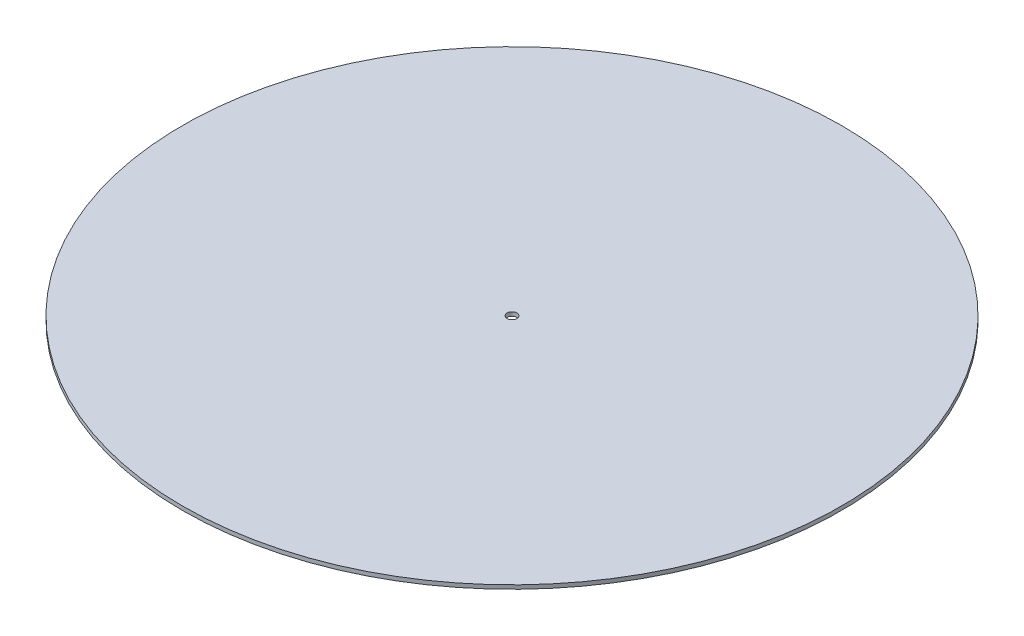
ISO-10303-21;
HEADER;
FILE_DESCRIPTION(('STEP AP214'),'2;1');
FILE_NAME('part.step','',(''),(''),'','','');
FILE_SCHEMA(('AUTOMOTIVE_DESIGN { 1 0 10303 214 1 1 1 1 }'));
ENDSEC;
DATA;
#1=APPLICATION_CONTEXT('core data for automotive mechanical design processes');
#2=APPLICATION_PROTOCOL_DEFINITION('international standard','automotive_design',2000,#1);
#3=PRODUCT_CONTEXT('',#1,'mechanical');
#4=PRODUCT('Part','Part','',(#3));
#5=PRODUCT_RELATED_PRODUCT_CATEGORY('part','',(#4));
#6=PRODUCT_DEFINITION_FORMATION('','',#4);
#7=PRODUCT_DEFINITION_CONTEXT('part definition',#1,'design');
#8=PRODUCT_DEFINITION('design','',#6,#7);
#9=PRODUCT_DEFINITION_SHAPE('','',#8);
#10=(LENGTH_UNIT() NAMED_UNIT(*) SI_UNIT(.MILLI.,.METRE.));
#11=(NAMED_UNIT(*) PLANE_ANGLE_UNIT() SI_UNIT($,.RADIAN.));
#12=(NAMED_UNIT(*) SI_UNIT($,.STERADIAN.) SOLID_ANGLE_UNIT());
#13=UNCERTAINTY_MEASURE_WITH_UNIT(LENGTH_MEASURE(1.E-05),#10,'distance_accuracy_value','');
#14=(GEOMETRIC_REPRESENTATION_CONTEXT(3) GLOBAL_UNCERTAINTY_ASSIGNED_CONTEXT((#13)) GLOBAL_UNIT_ASSIGNED_CONTEXT((#10,
#11,#12)) REPRESENTATION_CONTEXT('',''));
#15=CARTESIAN_POINT('',(0.,0.,0.));
#16=DIRECTION('',(0.,0.,1.));
#17=DIRECTION('',(1.,0.,0.));
#18=AXIS2_PLACEMENT_3D('',#15,#16,#17);
#19=CARTESIAN_POINT('',(0.,1.5875,0.));
#20=DIRECTION('',(0.,1.,0.));
#21=DIRECTION('',(0.,0.,1.));
#22=AXIS2_PLACEMENT_3D('',#19,#20,#21);
#23=PLANE('',#22);
#24=CARTESIAN_POINT('',(0.,1.5875,0.));
#25=DIRECTION('',(0.,1.,0.));
#26=DIRECTION('',(0.,0.,1.));
#27=AXIS2_PLACEMENT_3D('',#24,#25,#26);
#28=CIRCLE('',#27,134.62);
#29=CARTESIAN_POINT('',(0.,1.5875,134.62));
#30=VERTEX_POINT('',#29);
#31=EDGE_CURVE('E10',#30,#30,#28,.T.);
#32=ORIENTED_EDGE('',*,*,#31,.T.);
#33=EDGE_LOOP('',(#32));
#34=FACE_BOUND('',#33,.T.);
#35=CARTESIAN_POINT('',(0.,1.5875,0.));
#36=DIRECTION('',(0.,1.,0.));
#37=DIRECTION('',(0.,0.,1.));
#38=AXIS2_PLACEMENT_3D('',#35,#36,#37);
#39=CIRCLE('',#38,2.);
#40=CARTESIAN_POINT('',(0.,1.5875,2.));
#41=VERTEX_POINT('',#40);
#42=EDGE_CURVE('E50',#41,#41,#39,.T.);
#43=ORIENTED_EDGE('',*,*,#42,.F.);
#44=EDGE_LOOP('',(#43));
#45=FACE_BOUND('',#44,.T.);
#46=ADVANCED_FACE('F37',(#34,#45),#23,.T.);
#47=CARTESIAN_POINT('',(0.,0.,0.));
#48=DIRECTION('',(0.,1.,0.));
#49=DIRECTION('',(0.,0.,1.));
#50=AXIS2_PLACEMENT_3D('',#47,#48,#49);
#51=PLANE('',#50);
#52=CARTESIAN_POINT('',(0.,0.,0.));
#53=DIRECTION('',(0.,1.,0.));
#54=DIRECTION('',(0.,0.,1.));
#55=AXIS2_PLACEMENT_3D('',#52,#53,#54);
#56=CIRCLE('',#55,134.62);
#57=CARTESIAN_POINT('',(0.,0.,134.62));
#58=VERTEX_POINT('',#57);
#59=EDGE_CURVE('E41',#58,#58,#56,.T.);
#60=ORIENTED_EDGE('',*,*,#59,.F.);
#61=EDGE_LOOP('',(#60));
#62=FACE_BOUND('',#61,.T.);
#63=CARTESIAN_POINT('',(0.,0.,0.));
#64=DIRECTION('',(0.,1.,0.));
#65=DIRECTION('',(0.,0.,1.));
#66=AXIS2_PLACEMENT_3D('',#63,#64,#65);
#67=CIRCLE('',#66,2.);
#68=CARTESIAN_POINT('',(0.,0.,2.));
#69=VERTEX_POINT('',#68);
#70=EDGE_CURVE('E52',#69,#69,#67,.T.);
#71=ORIENTED_EDGE('',*,*,#70,.T.);
#72=EDGE_LOOP('',(#71));
#73=FACE_BOUND('',#72,.T.);
#74=ADVANCED_FACE('F64',(#62,#73),#51,.F.);
#75=CARTESIAN_POINT('',(0.,1.5875,0.));
#76=DIRECTION('',(0.,-1.,0.));
#77=DIRECTION('',(0.,0.,-1.));
#78=AXIS2_PLACEMENT_3D('',#75,#76,#77);
#79=CYLINDRICAL_SURFACE('',#78,134.62);
#80=ORIENTED_EDGE('',*,*,#31,.F.);
#81=EDGE_LOOP('',(#80));
#82=FACE_BOUND('',#81,.T.);
#83=ORIENTED_EDGE('',*,*,#59,.T.);
#84=EDGE_LOOP('',(#83));
#85=FACE_BOUND('',#84,.T.);
#86=ADVANCED_FACE('F39',(#82,#85),#79,.T.);
#87=CARTESIAN_POINT('',(0.,1.5875,0.));
#88=DIRECTION('',(0.,-1.,0.));
#89=DIRECTION('',(0.,0.,-1.));
#90=AXIS2_PLACEMENT_3D('',#87,#88,#89);
#91=CYLINDRICAL_SURFACE('',#90,2.);
#92=ORIENTED_EDGE('',*,*,#42,.T.);
#93=EDGE_LOOP('',(#92));
#94=FACE_BOUND('',#93,.T.);
#95=ORIENTED_EDGE('',*,*,#70,.F.);
#96=EDGE_LOOP('',(#95));
#97=FACE_BOUND('',#96,.T.);
#98=ADVANCED_FACE('F60',(#94,#97),#91,.F.);
#99=CLOSED_SHELL('',(#46,#74,#86,#98));
#100=MANIFOLD_SOLID_BREP('B2',#99);
#101=ADVANCED_BREP_SHAPE_REPRESENTATION('',(#18,#100),#14);
#102=SHAPE_DEFINITION_REPRESENTATION(#9,#101);
ENDSEC;
END-ISO-10303-21;
